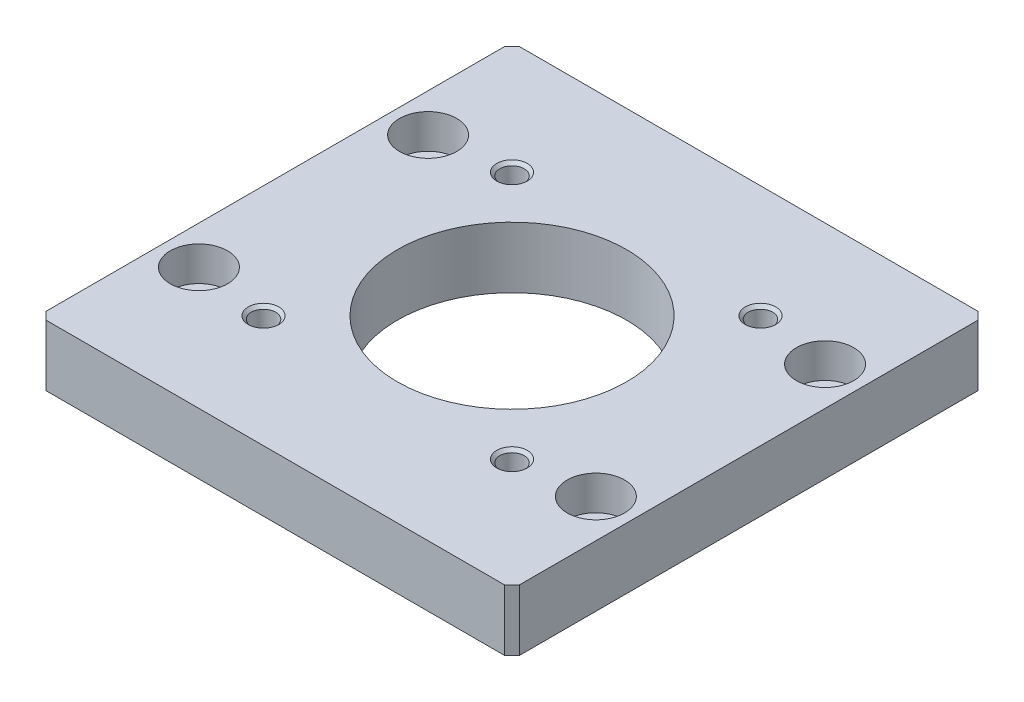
ISO-10303-21;
HEADER;
FILE_DESCRIPTION(('STEP AP214'),'2;1');
FILE_NAME('part.step','',(''),(''),'','','');
FILE_SCHEMA(('AUTOMOTIVE_DESIGN { 1 0 10303 214 1 1 1 1 }'));
ENDSEC;
DATA;
#1=APPLICATION_CONTEXT('core data for automotive mechanical design processes');
#2=APPLICATION_PROTOCOL_DEFINITION('international standard','automotive_design',2000,#1);
#3=PRODUCT_CONTEXT('',#1,'mechanical');
#4=PRODUCT('Part','Part','',(#3));
#5=PRODUCT_RELATED_PRODUCT_CATEGORY('part','',(#4));
#6=PRODUCT_DEFINITION_FORMATION('','',#4);
#7=PRODUCT_DEFINITION_CONTEXT('part definition',#1,'design');
#8=PRODUCT_DEFINITION('design','',#6,#7);
#9=PRODUCT_DEFINITION_SHAPE('','',#8);
#10=(LENGTH_UNIT() NAMED_UNIT(*) SI_UNIT(.MILLI.,.METRE.));
#11=(NAMED_UNIT(*) PLANE_ANGLE_UNIT() SI_UNIT($,.RADIAN.));
#12=(NAMED_UNIT(*) SI_UNIT($,.STERADIAN.) SOLID_ANGLE_UNIT());
#13=UNCERTAINTY_MEASURE_WITH_UNIT(LENGTH_MEASURE(1.E-05),#10,'distance_accuracy_value','');
#14=(GEOMETRIC_REPRESENTATION_CONTEXT(3) GLOBAL_UNCERTAINTY_ASSIGNED_CONTEXT((#13)) GLOBAL_UNIT_ASSIGNED_CONTEXT((#10,
#11,#12)) REPRESENTATION_CONTEXT('',''));
#15=CARTESIAN_POINT('',(0.,0.,0.));
#16=DIRECTION('',(0.,0.,1.));
#17=DIRECTION('',(1.,0.,0.));
#18=AXIS2_PLACEMENT_3D('',#15,#16,#17);
#19=CARTESIAN_POINT('',(-16.26345596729,7.59999999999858,-16.26345596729));
#20=DIRECTION('',(0.,1.,0.));
#21=DIRECTION('',(0.,0.,1.));
#22=AXIS2_PLACEMENT_3D('',#19,#20,#21);
#23=CONICAL_SURFACE('',#22,1.60000000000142,0.785398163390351);
#24=CARTESIAN_POINT('',(-16.26345596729,7.6,-16.26345596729));
#25=DIRECTION('',(0.,1.,0.));
#26=DIRECTION('',(1.,0.,0.));
#27=AXIS2_PLACEMENT_3D('',#24,#25,#26);
#28=CIRCLE('',#27,1.6);
#29=CARTESIAN_POINT('',(-14.66345596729,7.6,-16.26345596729));
#30=VERTEX_POINT('',#29);
#31=EDGE_CURVE('E191',#30,#30,#28,.F.);
#32=ORIENTED_EDGE('',*,*,#31,.T.);
#33=EDGE_LOOP('',(#32));
#34=FACE_BOUND('',#33,.T.);
#35=CARTESIAN_POINT('',(-16.26345596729,8.00000000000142,-16.26345596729));
#36=DIRECTION('',(0.,1.,0.));
#37=DIRECTION('',(0.,0.,1.));
#38=AXIS2_PLACEMENT_3D('',#35,#36,#37);
#39=CIRCLE('',#38,1.99999999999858);
#40=CARTESIAN_POINT('',(-16.26345596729,8.00000000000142,-14.2634559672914));
#41=VERTEX_POINT('',#40);
#42=EDGE_CURVE('E174',#41,#41,#39,.T.);
#43=ORIENTED_EDGE('',*,*,#42,.T.);
#44=EDGE_LOOP('',(#43));
#45=FACE_BOUND('',#44,.T.);
#46=ADVANCED_FACE('F16',(#34,#45),#23,.F.);
#47=CARTESIAN_POINT('',(16.26345596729,7.59999999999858,-16.26345596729));
#48=DIRECTION('',(0.,1.,0.));
#49=DIRECTION('',(0.,0.,1.));
#50=AXIS2_PLACEMENT_3D('',#47,#48,#49);
#51=CONICAL_SURFACE('',#50,1.60000000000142,0.785398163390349);
#52=CARTESIAN_POINT('',(16.26345596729,7.6,-16.26345596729));
#53=DIRECTION('',(0.,1.,0.));
#54=DIRECTION('',(1.,0.,0.));
#55=AXIS2_PLACEMENT_3D('',#52,#53,#54);
#56=CIRCLE('',#55,1.6);
#57=CARTESIAN_POINT('',(17.86345596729,7.6,-16.26345596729));
#58=VERTEX_POINT('',#57);
#59=EDGE_CURVE('E195',#58,#58,#56,.F.);
#60=ORIENTED_EDGE('',*,*,#59,.T.);
#61=EDGE_LOOP('',(#60));
#62=FACE_BOUND('',#61,.T.);
#63=CARTESIAN_POINT('',(16.26345596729,8.00000000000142,-16.26345596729));
#64=DIRECTION('',(0.,1.,0.));
#65=DIRECTION('',(0.,0.,1.));
#66=AXIS2_PLACEMENT_3D('',#63,#64,#65);
#67=CIRCLE('',#66,1.99999999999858);
#68=CARTESIAN_POINT('',(16.26345596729,8.00000000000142,-14.2634559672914));
#69=VERTEX_POINT('',#68);
#70=EDGE_CURVE('E171',#69,#69,#67,.T.);
#71=ORIENTED_EDGE('',*,*,#70,.T.);
#72=EDGE_LOOP('',(#71));
#73=FACE_BOUND('',#72,.T.);
#74=ADVANCED_FACE('F359',(#62,#73),#51,.F.);
#75=CARTESIAN_POINT('',(-16.26345596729,7.59999999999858,16.26345596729));
#76=DIRECTION('',(0.,1.,0.));
#77=DIRECTION('',(0.,0.,1.));
#78=AXIS2_PLACEMENT_3D('',#75,#76,#77);
#79=CONICAL_SURFACE('',#78,1.60000000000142,0.785398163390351);
#80=CARTESIAN_POINT('',(-16.26345596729,7.6,16.26345596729));
#81=DIRECTION('',(0.,1.,0.));
#82=DIRECTION('',(1.,0.,0.));
#83=AXIS2_PLACEMENT_3D('',#80,#81,#82);
#84=CIRCLE('',#83,1.6);
#85=CARTESIAN_POINT('',(-14.66345596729,7.6,16.26345596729));
#86=VERTEX_POINT('',#85);
#87=EDGE_CURVE('E208',#86,#86,#84,.F.);
#88=ORIENTED_EDGE('',*,*,#87,.T.);
#89=EDGE_LOOP('',(#88));
#90=FACE_BOUND('',#89,.T.);
#91=CARTESIAN_POINT('',(-16.26345596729,8.00000000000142,16.26345596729));
#92=DIRECTION('',(0.,1.,0.));
#93=DIRECTION('',(0.,0.,1.));
#94=AXIS2_PLACEMENT_3D('',#91,#92,#93);
#95=CIRCLE('',#94,1.99999999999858);
#96=CARTESIAN_POINT('',(-16.26345596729,8.00000000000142,18.2634559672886));
#97=VERTEX_POINT('',#96);
#98=EDGE_CURVE('E168',#97,#97,#95,.T.);
#99=ORIENTED_EDGE('',*,*,#98,.T.);
#100=EDGE_LOOP('',(#99));
#101=FACE_BOUND('',#100,.T.);
#102=ADVANCED_FACE('F355',(#90,#101),#79,.F.);
#103=CARTESIAN_POINT('',(16.26345596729,7.59999999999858,16.26345596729));
#104=DIRECTION('',(0.,1.,0.));
#105=DIRECTION('',(0.,0.,1.));
#106=AXIS2_PLACEMENT_3D('',#103,#104,#105);
#107=CONICAL_SURFACE('',#106,1.60000000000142,0.785398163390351);
#108=CARTESIAN_POINT('',(16.26345596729,7.6,16.26345596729));
#109=DIRECTION('',(0.,1.,0.));
#110=DIRECTION('',(1.,0.,0.));
#111=AXIS2_PLACEMENT_3D('',#108,#109,#110);
#112=CIRCLE('',#111,1.6);
#113=CARTESIAN_POINT('',(17.86345596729,7.6,16.26345596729));
#114=VERTEX_POINT('',#113);
#115=EDGE_CURVE('E200',#114,#114,#112,.F.);
#116=ORIENTED_EDGE('',*,*,#115,.T.);
#117=EDGE_LOOP('',(#116));
#118=FACE_BOUND('',#117,.T.);
#119=CARTESIAN_POINT('',(16.26345596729,8.00000000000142,16.26345596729));
#120=DIRECTION('',(0.,1.,0.));
#121=DIRECTION('',(0.,0.,1.));
#122=AXIS2_PLACEMENT_3D('',#119,#120,#121);
#123=CIRCLE('',#122,1.99999999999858);
#124=CARTESIAN_POINT('',(16.26345596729,8.00000000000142,18.2634559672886));
#125=VERTEX_POINT('',#124);
#126=EDGE_CURVE('E165',#125,#125,#123,.T.);
#127=ORIENTED_EDGE('',*,*,#126,.T.);
#128=EDGE_LOOP('',(#127));
#129=FACE_BOUND('',#128,.T.);
#130=ADVANCED_FACE('F352',(#118,#129),#107,.F.);
#131=CARTESIAN_POINT('',(25.98076211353,3.5,-15.));
#132=DIRECTION('',(0.,1.,0.));
#133=DIRECTION('',(0.,0.,1.));
#134=AXIS2_PLACEMENT_3D('',#131,#132,#133);
#135=CYLINDRICAL_SURFACE('',#134,3.75);
#136=CARTESIAN_POINT('',(25.98076211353,3.5,-15.));
#137=DIRECTION('',(0.,1.,0.));
#138=DIRECTION('',(0.,0.,1.));
#139=AXIS2_PLACEMENT_3D('',#136,#137,#138);
#140=CIRCLE('',#139,3.75);
#141=CARTESIAN_POINT('',(25.98076211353,3.5,-11.25));
#142=VERTEX_POINT('',#141);
#143=EDGE_CURVE('E20',#142,#142,#140,.F.);
#144=ORIENTED_EDGE('',*,*,#143,.T.);
#145=EDGE_LOOP('',(#144));
#146=FACE_BOUND('',#145,.T.);
#147=CARTESIAN_POINT('',(25.98076211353,8.,-15.));
#148=DIRECTION('',(0.,1.,0.));
#149=DIRECTION('',(0.,0.,1.));
#150=AXIS2_PLACEMENT_3D('',#147,#148,#149);
#151=CIRCLE('',#150,3.75);
#152=CARTESIAN_POINT('',(25.98076211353,8.,-11.25));
#153=VERTEX_POINT('',#152);
#154=EDGE_CURVE('E162',#153,#153,#151,.T.);
#155=ORIENTED_EDGE('',*,*,#154,.T.);
#156=EDGE_LOOP('',(#155));
#157=FACE_BOUND('',#156,.T.);
#158=ADVANCED_FACE('F348',(#146,#157),#135,.F.);
#159=CARTESIAN_POINT('',(-25.98076211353,3.5,-15.));
#160=DIRECTION('',(0.,1.,0.));
#161=DIRECTION('',(0.,0.,1.));
#162=AXIS2_PLACEMENT_3D('',#159,#160,#161);
#163=CYLINDRICAL_SURFACE('',#162,3.75);
#164=CARTESIAN_POINT('',(-25.98076211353,3.5,-15.));
#165=DIRECTION('',(0.,1.,0.));
#166=DIRECTION('',(0.,0.,1.));
#167=AXIS2_PLACEMENT_3D('',#164,#165,#166);
#168=CIRCLE('',#167,3.75);
#169=CARTESIAN_POINT('',(-25.98076211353,3.5,-11.25));
#170=VERTEX_POINT('',#169);
#171=EDGE_CURVE('E184',#170,#170,#168,.F.);
#172=ORIENTED_EDGE('',*,*,#171,.T.);
#173=EDGE_LOOP('',(#172));
#174=FACE_BOUND('',#173,.T.);
#175=CARTESIAN_POINT('',(-25.98076211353,8.,-15.));
#176=DIRECTION('',(0.,1.,0.));
#177=DIRECTION('',(0.,0.,1.));
#178=AXIS2_PLACEMENT_3D('',#175,#176,#177);
#179=CIRCLE('',#178,3.75);
#180=CARTESIAN_POINT('',(-25.98076211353,8.,-11.25));
#181=VERTEX_POINT('',#180);
#182=EDGE_CURVE('E159',#181,#181,#179,.T.);
#183=ORIENTED_EDGE('',*,*,#182,.T.);
#184=EDGE_LOOP('',(#183));
#185=FACE_BOUND('',#184,.T.);
#186=ADVANCED_FACE('F344',(#174,#185),#163,.F.);
#187=CARTESIAN_POINT('',(-25.98076211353,3.5,15.));
#188=DIRECTION('',(0.,1.,0.));
#189=DIRECTION('',(0.,0.,1.));
#190=AXIS2_PLACEMENT_3D('',#187,#188,#189);
#191=CYLINDRICAL_SURFACE('',#190,3.75);
#192=CARTESIAN_POINT('',(-25.98076211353,3.5,15.));
#193=DIRECTION('',(0.,1.,0.));
#194=DIRECTION('',(0.,0.,1.));
#195=AXIS2_PLACEMENT_3D('',#192,#193,#194);
#196=CIRCLE('',#195,3.75);
#197=CARTESIAN_POINT('',(-25.98076211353,3.5,18.75));
#198=VERTEX_POINT('',#197);
#199=EDGE_CURVE('E90',#198,#198,#196,.F.);
#200=ORIENTED_EDGE('',*,*,#199,.T.);
#201=EDGE_LOOP('',(#200));
#202=FACE_BOUND('',#201,.T.);
#203=CARTESIAN_POINT('',(-25.98076211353,8.,15.));
#204=DIRECTION('',(0.,1.,0.));
#205=DIRECTION('',(0.,0.,1.));
#206=AXIS2_PLACEMENT_3D('',#203,#204,#205);
#207=CIRCLE('',#206,3.75);
#208=CARTESIAN_POINT('',(-25.98076211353,8.,18.75));
#209=VERTEX_POINT('',#208);
#210=EDGE_CURVE('E107',#209,#209,#207,.T.);
#211=ORIENTED_EDGE('',*,*,#210,.T.);
#212=EDGE_LOOP('',(#211));
#213=FACE_BOUND('',#212,.T.);
#214=ADVANCED_FACE('F341',(#202,#213),#191,.F.);
#215=CARTESIAN_POINT('',(25.98076211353,3.5,15.));
#216=DIRECTION('',(0.,1.,0.));
#217=DIRECTION('',(0.,0.,1.));
#218=AXIS2_PLACEMENT_3D('',#215,#216,#217);
#219=CYLINDRICAL_SURFACE('',#218,3.75);
#220=CARTESIAN_POINT('',(25.98076211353,3.5,15.));
#221=DIRECTION('',(0.,1.,0.));
#222=DIRECTION('',(0.,0.,1.));
#223=AXIS2_PLACEMENT_3D('',#220,#221,#222);
#224=CIRCLE('',#223,3.75);
#225=CARTESIAN_POINT('',(25.98076211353,3.5,18.75));
#226=VERTEX_POINT('',#225);
#227=EDGE_CURVE('E186',#226,#226,#224,.F.);
#228=ORIENTED_EDGE('',*,*,#227,.T.);
#229=EDGE_LOOP('',(#228));
#230=FACE_BOUND('',#229,.T.);
#231=CARTESIAN_POINT('',(25.98076211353,8.,15.));
#232=DIRECTION('',(0.,1.,0.));
#233=DIRECTION('',(0.,0.,1.));
#234=AXIS2_PLACEMENT_3D('',#231,#232,#233);
#235=CIRCLE('',#234,3.75);
#236=CARTESIAN_POINT('',(25.98076211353,8.,18.75));
#237=VERTEX_POINT('',#236);
#238=EDGE_CURVE('E104',#237,#237,#235,.T.);
#239=ORIENTED_EDGE('',*,*,#238,.T.);
#240=EDGE_LOOP('',(#239));
#241=FACE_BOUND('',#240,.T.);
#242=ADVANCED_FACE('F338',(#230,#241),#219,.F.);
#243=CARTESIAN_POINT('',(-31.08184,8.16,-29.91816));
#244=DIRECTION('',(-0.707106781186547,0.,-0.707106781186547));
#245=DIRECTION('',(0.707106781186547,0.,-0.707106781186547));
#246=AXIS2_PLACEMENT_3D('',#243,#244,#245);
#247=PLANE('',#246);
#248=DIRECTION('',(0.707106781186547,0.,-0.707106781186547));
#249=VECTOR('',#248,1.);
#250=CARTESIAN_POINT('',(-31.08184,8.,-29.91816));
#251=LINE('',#250,#249);
#252=CARTESIAN_POINT('',(-31.,8.,-30.));
#253=VERTEX_POINT('',#252);
#254=CARTESIAN_POINT('',(-30.,8.,-31.));
#255=VERTEX_POINT('',#254);
#256=EDGE_CURVE('E177',#253,#255,#251,.T.);
#257=ORIENTED_EDGE('',*,*,#256,.T.);
#258=DIRECTION('',(0.,1.,0.));
#259=VECTOR('',#258,1.);
#260=CARTESIAN_POINT('',(-30.,4.,-31.));
#261=LINE('',#260,#259);
#262=CARTESIAN_POINT('',(-30.,0.,-31.));
#263=VERTEX_POINT('',#262);
#264=EDGE_CURVE('E100',#255,#263,#261,.F.);
#265=ORIENTED_EDGE('',*,*,#264,.T.);
#266=DIRECTION('',(-0.707106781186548,0.,0.707106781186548));
#267=VECTOR('',#266,1.);
#268=CARTESIAN_POINT('',(-30.5,0.,-30.5));
#269=LINE('',#268,#267);
#270=CARTESIAN_POINT('',(-31.,0.,-30.));
#271=VERTEX_POINT('',#270);
#272=EDGE_CURVE('E203',#271,#263,#269,.F.);
#273=ORIENTED_EDGE('',*,*,#272,.F.);
#274=DIRECTION('',(0.,-1.,0.));
#275=VECTOR('',#274,1.);
#276=CARTESIAN_POINT('',(-31.,4.,-30.));
#277=LINE('',#276,#275);
#278=EDGE_CURVE('E215',#271,#253,#277,.F.);
#279=ORIENTED_EDGE('',*,*,#278,.T.);
#280=EDGE_LOOP('',(#257,#265,#273,#279));
#281=FACE_BOUND('',#280,.T.);
#282=ADVANCED_FACE('F261',(#281),#247,.T.);
#283=CARTESIAN_POINT('',(-29.91816,8.16,31.08184));
#284=DIRECTION('',(-0.707106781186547,0.,0.707106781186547));
#285=DIRECTION('',(-0.707106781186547,0.,-0.707106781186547));
#286=AXIS2_PLACEMENT_3D('',#283,#284,#285);
#287=PLANE('',#286);
#288=DIRECTION('',(-0.707106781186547,0.,-0.707106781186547));
#289=VECTOR('',#288,1.);
#290=CARTESIAN_POINT('',(-29.91816,8.,31.08184));
#291=LINE('',#290,#289);
#292=CARTESIAN_POINT('',(-30.,8.,31.));
#293=VERTEX_POINT('',#292);
#294=CARTESIAN_POINT('',(-31.,8.,30.));
#295=VERTEX_POINT('',#294);
#296=EDGE_CURVE('E179',#293,#295,#291,.T.);
#297=ORIENTED_EDGE('',*,*,#296,.T.);
#298=DIRECTION('',(0.,1.,0.));
#299=VECTOR('',#298,1.);
#300=CARTESIAN_POINT('',(-31.,4.,30.));
#301=LINE('',#300,#299);
#302=CARTESIAN_POINT('',(-31.,0.,30.));
#303=VERTEX_POINT('',#302);
#304=EDGE_CURVE('E214',#295,#303,#301,.F.);
#305=ORIENTED_EDGE('',*,*,#304,.T.);
#306=DIRECTION('',(0.707106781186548,0.,0.707106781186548));
#307=VECTOR('',#306,1.);
#308=CARTESIAN_POINT('',(-30.5,0.,30.5));
#309=LINE('',#308,#307);
#310=CARTESIAN_POINT('',(-30.,0.,31.));
#311=VERTEX_POINT('',#310);
#312=EDGE_CURVE('E257',#311,#303,#309,.F.);
#313=ORIENTED_EDGE('',*,*,#312,.F.);
#314=DIRECTION('',(0.,-1.,0.));
#315=VECTOR('',#314,1.);
#316=CARTESIAN_POINT('',(-30.,4.,31.));
#317=LINE('',#316,#315);
#318=EDGE_CURVE('E222',#311,#293,#317,.F.);
#319=ORIENTED_EDGE('',*,*,#318,.T.);
#320=EDGE_LOOP('',(#297,#305,#313,#319));
#321=FACE_BOUND('',#320,.T.);
#322=ADVANCED_FACE('F267',(#321),#287,.T.);
#323=CARTESIAN_POINT('',(29.91816,8.16,-31.08184));
#324=DIRECTION('',(0.707106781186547,0.,-0.707106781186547));
#325=DIRECTION('',(0.707106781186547,0.,0.707106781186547));
#326=AXIS2_PLACEMENT_3D('',#323,#324,#325);
#327=PLANE('',#326);
#328=DIRECTION('',(0.707106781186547,0.,0.707106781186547));
#329=VECTOR('',#328,1.);
#330=CARTESIAN_POINT('',(29.91816,8.,-31.08184));
#331=LINE('',#330,#329);
#332=CARTESIAN_POINT('',(30.,8.,-31.));
#333=VERTEX_POINT('',#332);
#334=CARTESIAN_POINT('',(31.,8.,-30.));
#335=VERTEX_POINT('',#334);
#336=EDGE_CURVE('E80',#333,#335,#331,.T.);
#337=ORIENTED_EDGE('',*,*,#336,.T.);
#338=DIRECTION('',(0.,1.,0.));
#339=VECTOR('',#338,1.);
#340=CARTESIAN_POINT('',(31.,4.,-30.));
#341=LINE('',#340,#339);
#342=CARTESIAN_POINT('',(31.,0.,-30.));
#343=VERTEX_POINT('',#342);
#344=EDGE_CURVE('E113',#335,#343,#341,.F.);
#345=ORIENTED_EDGE('',*,*,#344,.T.);
#346=DIRECTION('',(-0.707106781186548,0.,-0.707106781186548));
#347=VECTOR('',#346,1.);
#348=CARTESIAN_POINT('',(30.5,0.,-30.5));
#349=LINE('',#348,#347);
#350=CARTESIAN_POINT('',(30.,0.,-31.));
#351=VERTEX_POINT('',#350);
#352=EDGE_CURVE('E103',#351,#343,#349,.F.);
#353=ORIENTED_EDGE('',*,*,#352,.F.);
#354=DIRECTION('',(0.,-1.,0.));
#355=VECTOR('',#354,1.);
#356=CARTESIAN_POINT('',(30.,4.,-31.));
#357=LINE('',#356,#355);
#358=EDGE_CURVE('E97',#351,#333,#357,.F.);
#359=ORIENTED_EDGE('',*,*,#358,.T.);
#360=EDGE_LOOP('',(#337,#345,#353,#359));
#361=FACE_BOUND('',#360,.T.);
#362=ADVANCED_FACE('F102',(#361),#327,.T.);
#363=CARTESIAN_POINT('',(31.08184,8.16,29.91816));
#364=DIRECTION('',(0.707106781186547,0.,0.707106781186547));
#365=DIRECTION('',(-0.707106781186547,0.,0.707106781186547));
#366=AXIS2_PLACEMENT_3D('',#363,#364,#365);
#367=PLANE('',#366);
#368=DIRECTION('',(-0.707106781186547,0.,0.707106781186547));
#369=VECTOR('',#368,1.);
#370=CARTESIAN_POINT('',(31.08184,8.,29.91816));
#371=LINE('',#370,#369);
#372=CARTESIAN_POINT('',(31.,8.,30.));
#373=VERTEX_POINT('',#372);
#374=CARTESIAN_POINT('',(30.,8.,31.));
#375=VERTEX_POINT('',#374);
#376=EDGE_CURVE('E89',#373,#375,#371,.T.);
#377=ORIENTED_EDGE('',*,*,#376,.T.);
#378=DIRECTION('',(0.,1.,0.));
#379=VECTOR('',#378,1.);
#380=CARTESIAN_POINT('',(30.,4.,31.));
#381=LINE('',#380,#379);
#382=CARTESIAN_POINT('',(30.,0.,31.));
#383=VERTEX_POINT('',#382);
#384=EDGE_CURVE('E111',#375,#383,#381,.F.);
#385=ORIENTED_EDGE('',*,*,#384,.T.);
#386=DIRECTION('',(0.707106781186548,0.,-0.707106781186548));
#387=VECTOR('',#386,1.);
#388=CARTESIAN_POINT('',(30.5,0.,30.5));
#389=LINE('',#388,#387);
#390=CARTESIAN_POINT('',(31.,0.,30.));
#391=VERTEX_POINT('',#390);
#392=EDGE_CURVE('E35',#391,#383,#389,.F.);
#393=ORIENTED_EDGE('',*,*,#392,.F.);
#394=DIRECTION('',(0.,-1.,0.));
#395=VECTOR('',#394,1.);
#396=CARTESIAN_POINT('',(31.,4.,30.));
#397=LINE('',#396,#395);
#398=EDGE_CURVE('E114',#391,#373,#397,.F.);
#399=ORIENTED_EDGE('',*,*,#398,.T.);
#400=EDGE_LOOP('',(#377,#385,#393,#399));
#401=FACE_BOUND('',#400,.T.);
#402=ADVANCED_FACE('F228',(#401),#367,.T.);
#403=CARTESIAN_POINT('',(-16.26345596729,0.4,16.26345596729));
#404=DIRECTION('',(0.,1.,0.));
#405=DIRECTION('',(0.,0.,1.));
#406=AXIS2_PLACEMENT_3D('',#403,#404,#405);
#407=CYLINDRICAL_SURFACE('',#406,1.6);
#408=CARTESIAN_POINT('',(-16.26345596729,0.40000000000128,16.26345596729));
#409=DIRECTION('',(0.,-1.,0.));
#410=DIRECTION('',(0.,0.,-1.));
#411=AXIS2_PLACEMENT_3D('',#408,#409,#410);
#412=CIRCLE('',#411,1.60000000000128);
#413=CARTESIAN_POINT('',(-16.26345596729,0.40000000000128,14.6634559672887));
#414=VERTEX_POINT('',#413);
#415=EDGE_CURVE('E227',#414,#414,#412,.T.);
#416=ORIENTED_EDGE('',*,*,#415,.T.);
#417=EDGE_LOOP('',(#416));
#418=FACE_BOUND('',#417,.T.);
#419=ORIENTED_EDGE('',*,*,#87,.F.);
#420=EDGE_LOOP('',(#419));
#421=FACE_BOUND('',#420,.T.);
#422=ADVANCED_FACE('F333',(#418,#421),#407,.F.);
#423=CARTESIAN_POINT('',(16.26345596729,0.4,16.26345596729));
#424=DIRECTION('',(0.,1.,0.));
#425=DIRECTION('',(0.,0.,1.));
#426=AXIS2_PLACEMENT_3D('',#423,#424,#425);
#427=CYLINDRICAL_SURFACE('',#426,1.6);
#428=CARTESIAN_POINT('',(16.26345596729,0.40000000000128,16.26345596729));
#429=DIRECTION('',(0.,-1.,0.));
#430=DIRECTION('',(0.,0.,-1.));
#431=AXIS2_PLACEMENT_3D('',#428,#429,#430);
#432=CIRCLE('',#431,1.60000000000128);
#433=CARTESIAN_POINT('',(16.26345596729,0.40000000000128,14.6634559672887));
#434=VERTEX_POINT('',#433);
#435=EDGE_CURVE('E251',#434,#434,#432,.T.);
#436=ORIENTED_EDGE('',*,*,#435,.T.);
#437=EDGE_LOOP('',(#436));
#438=FACE_BOUND('',#437,.T.);
#439=ORIENTED_EDGE('',*,*,#115,.F.);
#440=EDGE_LOOP('',(#439));
#441=FACE_BOUND('',#440,.T.);
#442=ADVANCED_FACE('F329',(#438,#441),#427,.F.);
#443=CARTESIAN_POINT('',(16.26345596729,0.4,-16.26345596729));
#444=DIRECTION('',(0.,1.,0.));
#445=DIRECTION('',(0.,0.,1.));
#446=AXIS2_PLACEMENT_3D('',#443,#444,#445);
#447=CYLINDRICAL_SURFACE('',#446,1.6);
#448=CARTESIAN_POINT('',(16.26345596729,0.40000000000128,-16.26345596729));
#449=DIRECTION('',(0.,-1.,0.));
#450=DIRECTION('',(0.,0.,-1.));
#451=AXIS2_PLACEMENT_3D('',#448,#449,#450);
#452=CIRCLE('',#451,1.60000000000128);
#453=CARTESIAN_POINT('',(16.26345596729,0.40000000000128,-17.8634559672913));
#454=VERTEX_POINT('',#453);
#455=EDGE_CURVE('E248',#454,#454,#452,.T.);
#456=ORIENTED_EDGE('',*,*,#455,.T.);
#457=EDGE_LOOP('',(#456));
#458=FACE_BOUND('',#457,.T.);
#459=ORIENTED_EDGE('',*,*,#59,.F.);
#460=EDGE_LOOP('',(#459));
#461=FACE_BOUND('',#460,.T.);
#462=ADVANCED_FACE('F325',(#458,#461),#447,.F.);
#463=CARTESIAN_POINT('',(-16.26345596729,0.4,-16.26345596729));
#464=DIRECTION('',(0.,1.,0.));
#465=DIRECTION('',(0.,0.,1.));
#466=AXIS2_PLACEMENT_3D('',#463,#464,#465);
#467=CYLINDRICAL_SURFACE('',#466,1.6);
#468=CARTESIAN_POINT('',(-16.26345596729,0.40000000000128,-16.26345596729));
#469=DIRECTION('',(0.,-1.,0.));
#470=DIRECTION('',(0.,0.,-1.));
#471=AXIS2_PLACEMENT_3D('',#468,#469,#470);
#472=CIRCLE('',#471,1.60000000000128);
#473=CARTESIAN_POINT('',(-16.26345596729,0.40000000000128,-17.8634559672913));
#474=VERTEX_POINT('',#473);
#475=EDGE_CURVE('E155',#474,#474,#472,.T.);
#476=ORIENTED_EDGE('',*,*,#475,.T.);
#477=EDGE_LOOP('',(#476));
#478=FACE_BOUND('',#477,.T.);
#479=ORIENTED_EDGE('',*,*,#31,.F.);
#480=EDGE_LOOP('',(#479));
#481=FACE_BOUND('',#480,.T.);
#482=ADVANCED_FACE('F321',(#478,#481),#467,.F.);
#483=CARTESIAN_POINT('',(-30.91999259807,3.5,19.50812731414));
#484=DIRECTION('',(0.,1.,0.));
#485=DIRECTION('',(1.,0.,0.));
#486=AXIS2_PLACEMENT_3D('',#483,#484,#485);
#487=PLANE('',#486);
#488=CARTESIAN_POINT('',(25.98076211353,3.5,-15.));
#489=DIRECTION('',(0.,1.,0.));
#490=DIRECTION('',(0.,0.,1.));
#491=AXIS2_PLACEMENT_3D('',#488,#489,#490);
#492=CIRCLE('',#491,2.25);
#493=CARTESIAN_POINT('',(25.98076211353,3.5,-12.75));
#494=VERTEX_POINT('',#493);
#495=EDGE_CURVE('E153',#494,#494,#492,.F.);
#496=ORIENTED_EDGE('',*,*,#495,.T.);
#497=EDGE_LOOP('',(#496));
#498=FACE_BOUND('',#497,.T.);
#499=ORIENTED_EDGE('',*,*,#143,.F.);
#500=EDGE_LOOP('',(#499));
#501=FACE_BOUND('',#500,.T.);
#502=ADVANCED_FACE('F324',(#498,#501),#487,.T.);
#503=CARTESIAN_POINT('',(-30.91999259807,3.5,19.50812731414));
#504=DIRECTION('',(0.,1.,0.));
#505=DIRECTION('',(1.,0.,0.));
#506=AXIS2_PLACEMENT_3D('',#503,#504,#505);
#507=PLANE('',#506);
#508=CARTESIAN_POINT('',(25.98076211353,3.5,15.));
#509=DIRECTION('',(0.,1.,0.));
#510=DIRECTION('',(0.,0.,1.));
#511=AXIS2_PLACEMENT_3D('',#508,#509,#510);
#512=CIRCLE('',#511,2.25);
#513=CARTESIAN_POINT('',(25.98076211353,3.5,17.25));
#514=VERTEX_POINT('',#513);
#515=EDGE_CURVE('E150',#514,#514,#512,.F.);
#516=ORIENTED_EDGE('',*,*,#515,.T.);
#517=EDGE_LOOP('',(#516));
#518=FACE_BOUND('',#517,.T.);
#519=ORIENTED_EDGE('',*,*,#227,.F.);
#520=EDGE_LOOP('',(#519));
#521=FACE_BOUND('',#520,.T.);
#522=ADVANCED_FACE('F376',(#518,#521),#507,.T.);
#523=CARTESIAN_POINT('',(-30.91999259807,3.5,19.50812731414));
#524=DIRECTION('',(0.,1.,0.));
#525=DIRECTION('',(1.,0.,0.));
#526=AXIS2_PLACEMENT_3D('',#523,#524,#525);
#527=PLANE('',#526);
#528=CARTESIAN_POINT('',(-25.98076211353,3.5,-15.));
#529=DIRECTION('',(0.,1.,0.));
#530=DIRECTION('',(0.,0.,1.));
#531=AXIS2_PLACEMENT_3D('',#528,#529,#530);
#532=CIRCLE('',#531,2.25);
#533=CARTESIAN_POINT('',(-25.98076211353,3.5,-12.75));
#534=VERTEX_POINT('',#533);
#535=EDGE_CURVE('E147',#534,#534,#532,.F.);
#536=ORIENTED_EDGE('',*,*,#535,.T.);
#537=EDGE_LOOP('',(#536));
#538=FACE_BOUND('',#537,.T.);
#539=ORIENTED_EDGE('',*,*,#171,.F.);
#540=EDGE_LOOP('',(#539));
#541=FACE_BOUND('',#540,.T.);
#542=ADVANCED_FACE('F380',(#538,#541),#527,.T.);
#543=CARTESIAN_POINT('',(-30.91999259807,3.5,19.50812731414));
#544=DIRECTION('',(0.,1.,0.));
#545=DIRECTION('',(1.,0.,0.));
#546=AXIS2_PLACEMENT_3D('',#543,#544,#545);
#547=PLANE('',#546);
#548=CARTESIAN_POINT('',(-25.98076211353,3.5,15.));
#549=DIRECTION('',(0.,1.,0.));
#550=DIRECTION('',(0.,0.,1.));
#551=AXIS2_PLACEMENT_3D('',#548,#549,#550);
#552=CIRCLE('',#551,2.25);
#553=CARTESIAN_POINT('',(-25.98076211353,3.5,17.25));
#554=VERTEX_POINT('',#553);
#555=EDGE_CURVE('E144',#554,#554,#552,.F.);
#556=ORIENTED_EDGE('',*,*,#555,.T.);
#557=EDGE_LOOP('',(#556));
#558=FACE_BOUND('',#557,.T.);
#559=ORIENTED_EDGE('',*,*,#199,.F.);
#560=EDGE_LOOP('',(#559));
#561=FACE_BOUND('',#560,.T.);
#562=ADVANCED_FACE('F384',(#558,#561),#547,.T.);
#563=CARTESIAN_POINT('',(-32.24,8.,32.24));
#564=DIRECTION('',(0.,1.,0.));
#565=DIRECTION('',(1.,0.,0.));
#566=AXIS2_PLACEMENT_3D('',#563,#564,#565);
#567=PLANE('',#566);
#568=CARTESIAN_POINT('',(0.,8.,0.));
#569=DIRECTION('',(0.,1.,0.));
#570=DIRECTION('',(0.,0.,1.));
#571=AXIS2_PLACEMENT_3D('',#568,#569,#570);
#572=CIRCLE('',#571,15.);
#573=CARTESIAN_POINT('',(0.,8.,15.));
#574=VERTEX_POINT('',#573);
#575=EDGE_CURVE('E140',#574,#574,#572,.F.);
#576=ORIENTED_EDGE('',*,*,#575,.T.);
#577=EDGE_LOOP('',(#576));
#578=FACE_BOUND('',#577,.T.);
#579=ORIENTED_EDGE('',*,*,#238,.F.);
#580=EDGE_LOOP('',(#579));
#581=FACE_BOUND('',#580,.T.);
#582=ORIENTED_EDGE('',*,*,#210,.F.);
#583=EDGE_LOOP('',(#582));
#584=FACE_BOUND('',#583,.T.);
#585=ORIENTED_EDGE('',*,*,#182,.F.);
#586=EDGE_LOOP('',(#585));
#587=FACE_BOUND('',#586,.T.);
#588=ORIENTED_EDGE('',*,*,#154,.F.);
#589=EDGE_LOOP('',(#588));
#590=FACE_BOUND('',#589,.T.);
#591=ORIENTED_EDGE('',*,*,#126,.F.);
#592=EDGE_LOOP('',(#591));
#593=FACE_BOUND('',#592,.T.);
#594=ORIENTED_EDGE('',*,*,#98,.F.);
#595=EDGE_LOOP('',(#594));
#596=FACE_BOUND('',#595,.T.);
#597=ORIENTED_EDGE('',*,*,#70,.F.);
#598=EDGE_LOOP('',(#597));
#599=FACE_BOUND('',#598,.T.);
#600=ORIENTED_EDGE('',*,*,#42,.F.);
#601=EDGE_LOOP('',(#600));
#602=FACE_BOUND('',#601,.T.);
#603=ORIENTED_EDGE('',*,*,#256,.F.);
#604=DIRECTION('',(0.,0.,-1.));
#605=VECTOR('',#604,1.);
#606=CARTESIAN_POINT('',(-31.,8.,0.));
#607=LINE('',#606,#605);
#608=EDGE_CURVE('E211',#253,#295,#607,.F.);
#609=ORIENTED_EDGE('',*,*,#608,.T.);
#610=ORIENTED_EDGE('',*,*,#296,.F.);
#611=DIRECTION('',(-1.,0.,0.));
#612=VECTOR('',#611,1.);
#613=CARTESIAN_POINT('',(0.,8.,31.));
#614=LINE('',#613,#612);
#615=EDGE_CURVE('E219',#293,#375,#614,.F.);
#616=ORIENTED_EDGE('',*,*,#615,.T.);
#617=ORIENTED_EDGE('',*,*,#376,.F.);
#618=DIRECTION('',(0.,0.,1.));
#619=VECTOR('',#618,1.);
#620=CARTESIAN_POINT('',(31.,8.,0.));
#621=LINE('',#620,#619);
#622=EDGE_CURVE('E85',#373,#335,#621,.F.);
#623=ORIENTED_EDGE('',*,*,#622,.T.);
#624=ORIENTED_EDGE('',*,*,#336,.F.);
#625=DIRECTION('',(1.,0.,0.));
#626=VECTOR('',#625,1.);
#627=CARTESIAN_POINT('',(0.,8.,-31.));
#628=LINE('',#627,#626);
#629=EDGE_CURVE('E83',#333,#255,#628,.F.);
#630=ORIENTED_EDGE('',*,*,#629,.T.);
#631=EDGE_LOOP('',(#603,#609,#610,#616,#617,#623,#624,#630));
#632=FACE_BOUND('',#631,.T.);
#633=ADVANCED_FACE('F82',(#578,#581,#584,#587,#590,#593,#596,#599,#602,#632),#567,.T.);
#634=CARTESIAN_POINT('',(31.2,-0.16,-31.));
#635=DIRECTION('',(0.,0.,-1.));
#636=DIRECTION('',(-1.,0.,0.));
#637=AXIS2_PLACEMENT_3D('',#634,#635,#636);
#638=PLANE('',#637);
#639=ORIENTED_EDGE('',*,*,#264,.F.);
#640=ORIENTED_EDGE('',*,*,#629,.F.);
#641=ORIENTED_EDGE('',*,*,#358,.F.);
#642=DIRECTION('',(-1.,0.,0.));
#643=VECTOR('',#642,1.);
#644=CARTESIAN_POINT('',(0.,0.,-31.));
#645=LINE('',#644,#643);
#646=EDGE_CURVE('E143',#351,#263,#645,.T.);
#647=ORIENTED_EDGE('',*,*,#646,.T.);
#648=EDGE_LOOP('',(#639,#640,#641,#647));
#649=FACE_BOUND('',#648,.T.);
#650=ADVANCED_FACE('F95',(#649),#638,.T.);
#651=CARTESIAN_POINT('',(-31.,-0.16,-31.2));
#652=DIRECTION('',(-1.,0.,0.));
#653=DIRECTION('',(0.,0.,1.));
#654=AXIS2_PLACEMENT_3D('',#651,#652,#653);
#655=PLANE('',#654);
#656=ORIENTED_EDGE('',*,*,#304,.F.);
#657=ORIENTED_EDGE('',*,*,#608,.F.);
#658=ORIENTED_EDGE('',*,*,#278,.F.);
#659=DIRECTION('',(0.,0.,1.));
#660=VECTOR('',#659,1.);
#661=CARTESIAN_POINT('',(-31.,0.,0.));
#662=LINE('',#661,#660);
#663=EDGE_CURVE('E240',#271,#303,#662,.T.);
#664=ORIENTED_EDGE('',*,*,#663,.T.);
#665=EDGE_LOOP('',(#656,#657,#658,#664));
#666=FACE_BOUND('',#665,.T.);
#667=ADVANCED_FACE('F265',(#666),#655,.T.);
#668=CARTESIAN_POINT('',(-31.2,-0.16,31.));
#669=DIRECTION('',(0.,0.,1.));
#670=DIRECTION('',(1.,0.,0.));
#671=AXIS2_PLACEMENT_3D('',#668,#669,#670);
#672=PLANE('',#671);
#673=ORIENTED_EDGE('',*,*,#384,.F.);
#674=ORIENTED_EDGE('',*,*,#615,.F.);
#675=ORIENTED_EDGE('',*,*,#318,.F.);
#676=DIRECTION('',(1.,0.,0.));
#677=VECTOR('',#676,1.);
#678=CARTESIAN_POINT('',(0.,0.,31.));
#679=LINE('',#678,#677);
#680=EDGE_CURVE('E237',#311,#383,#679,.T.);
#681=ORIENTED_EDGE('',*,*,#680,.T.);
#682=EDGE_LOOP('',(#673,#674,#675,#681));
#683=FACE_BOUND('',#682,.T.);
#684=ADVANCED_FACE('F271',(#683),#672,.T.);
#685=CARTESIAN_POINT('',(31.,-0.16,31.2));
#686=DIRECTION('',(1.,0.,0.));
#687=DIRECTION('',(0.,0.,-1.));
#688=AXIS2_PLACEMENT_3D('',#685,#686,#687);
#689=PLANE('',#688);
#690=ORIENTED_EDGE('',*,*,#398,.F.);
#691=DIRECTION('',(0.,0.,-1.));
#692=VECTOR('',#691,1.);
#693=CARTESIAN_POINT('',(31.,0.,0.));
#694=LINE('',#693,#692);
#695=EDGE_CURVE('E139',#391,#343,#694,.T.);
#696=ORIENTED_EDGE('',*,*,#695,.T.);
#697=ORIENTED_EDGE('',*,*,#344,.F.);
#698=ORIENTED_EDGE('',*,*,#622,.F.);
#699=EDGE_LOOP('',(#690,#696,#697,#698));
#700=FACE_BOUND('',#699,.T.);
#701=ADVANCED_FACE('F233',(#700),#689,.T.);
#702=CARTESIAN_POINT('',(-16.26345596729,0.400000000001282,16.26345596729));
#703=DIRECTION('',(0.,-1.,0.));
#704=DIRECTION('',(1.,0.,0.));
#705=AXIS2_PLACEMENT_3D('',#702,#703,#704);
#706=CONICAL_SURFACE('',#705,1.60000000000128,0.785398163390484);
#707=ORIENTED_EDGE('',*,*,#415,.F.);
#708=EDGE_LOOP('',(#707));
#709=FACE_BOUND('',#708,.T.);
#710=CARTESIAN_POINT('',(-16.26345596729,-1.50752891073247E-12,16.26345596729));
#711=DIRECTION('',(0.,-1.,0.));
#712=DIRECTION('',(1.,0.,0.));
#713=AXIS2_PLACEMENT_3D('',#710,#711,#712);
#714=CIRCLE('',#713,1.99999999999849);
#715=CARTESIAN_POINT('',(-14.2634559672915,-1.50756279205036E-12,16.26345596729));
#716=VERTEX_POINT('',#715);
#717=EDGE_CURVE('E136',#716,#716,#714,.T.);
#718=ORIENTED_EDGE('',*,*,#717,.T.);
#719=EDGE_LOOP('',(#718));
#720=FACE_BOUND('',#719,.T.);
#721=ADVANCED_FACE('F279',(#709,#720),#706,.F.);
#722=CARTESIAN_POINT('',(16.26345596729,0.40000000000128,16.26345596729));
#723=DIRECTION('',(0.,-1.,0.));
#724=DIRECTION('',(0.,0.,-1.));
#725=AXIS2_PLACEMENT_3D('',#722,#723,#724);
#726=CONICAL_SURFACE('',#725,1.60000000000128,0.785398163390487);
#727=ORIENTED_EDGE('',*,*,#435,.F.);
#728=EDGE_LOOP('',(#727));
#729=FACE_BOUND('',#728,.T.);
#730=CARTESIAN_POINT('',(16.26345596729,-1.50498103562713E-12,16.26345596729));
#731=DIRECTION('',(0.,-1.,0.));
#732=DIRECTION('',(1.,0.,0.));
#733=AXIS2_PLACEMENT_3D('',#730,#731,#732);
#734=CIRCLE('',#733,1.9999999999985);
#735=CARTESIAN_POINT('',(18.2634559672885,-1.50501491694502E-12,16.26345596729));
#736=VERTEX_POINT('',#735);
#737=EDGE_CURVE('E133',#736,#736,#734,.T.);
#738=ORIENTED_EDGE('',*,*,#737,.T.);
#739=EDGE_LOOP('',(#738));
#740=FACE_BOUND('',#739,.T.);
#741=ADVANCED_FACE('F309',(#729,#740),#726,.F.);
#742=CARTESIAN_POINT('',(16.26345596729,0.40000000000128,-16.26345596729));
#743=DIRECTION('',(0.,-1.,0.));
#744=DIRECTION('',(0.,0.,-1.));
#745=AXIS2_PLACEMENT_3D('',#742,#743,#744);
#746=CONICAL_SURFACE('',#745,1.60000000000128,0.785398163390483);
#747=ORIENTED_EDGE('',*,*,#455,.F.);
#748=EDGE_LOOP('',(#747));
#749=FACE_BOUND('',#748,.T.);
#750=CARTESIAN_POINT('',(16.26345596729,-1.50573997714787E-12,-16.26345596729));
#751=DIRECTION('',(0.,-1.,0.));
#752=DIRECTION('',(0.,0.,-1.));
#753=AXIS2_PLACEMENT_3D('',#750,#751,#752);
#754=CIRCLE('',#753,1.99999999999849);
#755=CARTESIAN_POINT('',(16.26345596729,-1.50573997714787E-12,-18.2634559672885));
#756=VERTEX_POINT('',#755);
#757=EDGE_CURVE('E130',#756,#756,#754,.T.);
#758=ORIENTED_EDGE('',*,*,#757,.T.);
#759=EDGE_LOOP('',(#758));
#760=FACE_BOUND('',#759,.T.);
#761=ADVANCED_FACE('F315',(#749,#760),#746,.F.);
#762=CARTESIAN_POINT('',(-16.26345596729,0.40000000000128,-16.26345596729));
#763=DIRECTION('',(0.,-1.,0.));
#764=DIRECTION('',(0.,0.,-1.));
#765=AXIS2_PLACEMENT_3D('',#762,#763,#764);
#766=CONICAL_SURFACE('',#765,1.60000000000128,0.785398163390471);
#767=ORIENTED_EDGE('',*,*,#475,.F.);
#768=EDGE_LOOP('',(#767));
#769=FACE_BOUND('',#768,.T.);
#770=CARTESIAN_POINT('',(-16.26345596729,-1.50660733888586E-12,-16.26345596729));
#771=DIRECTION('',(0.,-1.,0.));
#772=DIRECTION('',(0.,0.,-1.));
#773=AXIS2_PLACEMENT_3D('',#770,#771,#772);
#774=CIRCLE('',#773,1.9999999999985);
#775=CARTESIAN_POINT('',(-16.26345596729,-1.50660733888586E-12,-18.2634559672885));
#776=VERTEX_POINT('',#775);
#777=EDGE_CURVE('E127',#776,#776,#774,.T.);
#778=ORIENTED_EDGE('',*,*,#777,.T.);
#779=EDGE_LOOP('',(#778));
#780=FACE_BOUND('',#779,.T.);
#781=ADVANCED_FACE('F435',(#769,#780),#766,.F.);
#782=CARTESIAN_POINT('',(25.98076211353,0.,-15.));
#783=DIRECTION('',(0.,1.,0.));
#784=DIRECTION('',(0.,0.,1.));
#785=AXIS2_PLACEMENT_3D('',#782,#783,#784);
#786=CYLINDRICAL_SURFACE('',#785,2.25);
#787=CARTESIAN_POINT('',(25.98076211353,0.,-15.));
#788=DIRECTION('',(0.,1.,0.));
#789=DIRECTION('',(0.,0.,1.));
#790=AXIS2_PLACEMENT_3D('',#787,#788,#789);
#791=CIRCLE('',#790,2.25);
#792=CARTESIAN_POINT('',(25.98076211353,0.,-12.75));
#793=VERTEX_POINT('',#792);
#794=EDGE_CURVE('E124',#793,#793,#791,.F.);
#795=ORIENTED_EDGE('',*,*,#794,.T.);
#796=EDGE_LOOP('',(#795));
#797=FACE_BOUND('',#796,.T.);
#798=ORIENTED_EDGE('',*,*,#495,.F.);
#799=EDGE_LOOP('',(#798));
#800=FACE_BOUND('',#799,.T.);
#801=ADVANCED_FACE('F444',(#797,#800),#786,.F.);
#802=CARTESIAN_POINT('',(25.98076211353,0.,15.));
#803=DIRECTION('',(0.,1.,0.));
#804=DIRECTION('',(0.,0.,1.));
#805=AXIS2_PLACEMENT_3D('',#802,#803,#804);
#806=CYLINDRICAL_SURFACE('',#805,2.25);
#807=CARTESIAN_POINT('',(25.98076211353,0.,15.));
#808=DIRECTION('',(0.,1.,0.));
#809=DIRECTION('',(0.,0.,1.));
#810=AXIS2_PLACEMENT_3D('',#807,#808,#809);
#811=CIRCLE('',#810,2.25);
#812=CARTESIAN_POINT('',(25.98076211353,0.,17.25));
#813=VERTEX_POINT('',#812);
#814=EDGE_CURVE('E121',#813,#813,#811,.F.);
#815=ORIENTED_EDGE('',*,*,#814,.T.);
#816=EDGE_LOOP('',(#815));
#817=FACE_BOUND('',#816,.T.);
#818=ORIENTED_EDGE('',*,*,#515,.F.);
#819=EDGE_LOOP('',(#818));
#820=FACE_BOUND('',#819,.T.);
#821=ADVANCED_FACE('F454',(#817,#820),#806,.F.);
#822=CARTESIAN_POINT('',(-25.98076211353,0.,-15.));
#823=DIRECTION('',(0.,1.,0.));
#824=DIRECTION('',(0.,0.,1.));
#825=AXIS2_PLACEMENT_3D('',#822,#823,#824);
#826=CYLINDRICAL_SURFACE('',#825,2.25);
#827=CARTESIAN_POINT('',(-25.98076211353,0.,-15.));
#828=DIRECTION('',(0.,1.,0.));
#829=DIRECTION('',(0.,0.,1.));
#830=AXIS2_PLACEMENT_3D('',#827,#828,#829);
#831=CIRCLE('',#830,2.25);
#832=CARTESIAN_POINT('',(-25.98076211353,0.,-12.75));
#833=VERTEX_POINT('',#832);
#834=EDGE_CURVE('E118',#833,#833,#831,.F.);
#835=ORIENTED_EDGE('',*,*,#834,.T.);
#836=EDGE_LOOP('',(#835));
#837=FACE_BOUND('',#836,.T.);
#838=ORIENTED_EDGE('',*,*,#535,.F.);
#839=EDGE_LOOP('',(#838));
#840=FACE_BOUND('',#839,.T.);
#841=ADVANCED_FACE('F464',(#837,#840),#826,.F.);
#842=CARTESIAN_POINT('',(-25.98076211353,0.,15.));
#843=DIRECTION('',(0.,1.,0.));
#844=DIRECTION('',(0.,0.,1.));
#845=AXIS2_PLACEMENT_3D('',#842,#843,#844);
#846=CYLINDRICAL_SURFACE('',#845,2.25);
#847=CARTESIAN_POINT('',(-25.98076211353,0.,15.));
#848=DIRECTION('',(0.,1.,0.));
#849=DIRECTION('',(0.,0.,1.));
#850=AXIS2_PLACEMENT_3D('',#847,#848,#849);
#851=CIRCLE('',#850,2.25);
#852=CARTESIAN_POINT('',(-25.98076211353,0.,17.25));
#853=VERTEX_POINT('',#852);
#854=EDGE_CURVE('E26',#853,#853,#851,.F.);
#855=ORIENTED_EDGE('',*,*,#854,.T.);
#856=EDGE_LOOP('',(#855));
#857=FACE_BOUND('',#856,.T.);
#858=ORIENTED_EDGE('',*,*,#555,.F.);
#859=EDGE_LOOP('',(#858));
#860=FACE_BOUND('',#859,.T.);
#861=ADVANCED_FACE('F287',(#857,#860),#846,.F.);
#862=CARTESIAN_POINT('',(0.,0.,0.));
#863=DIRECTION('',(0.,1.,0.));
#864=DIRECTION('',(0.,0.,1.));
#865=AXIS2_PLACEMENT_3D('',#862,#863,#864);
#866=CYLINDRICAL_SURFACE('',#865,15.);
#867=ORIENTED_EDGE('',*,*,#575,.F.);
#868=EDGE_LOOP('',(#867));
#869=FACE_BOUND('',#868,.T.);
#870=CARTESIAN_POINT('',(0.,0.,0.));
#871=DIRECTION('',(0.,1.,0.));
#872=DIRECTION('',(0.,0.,1.));
#873=AXIS2_PLACEMENT_3D('',#870,#871,#872);
#874=CIRCLE('',#873,15.);
#875=CARTESIAN_POINT('',(0.,0.,15.));
#876=VERTEX_POINT('',#875);
#877=EDGE_CURVE('E10',#876,#876,#874,.F.);
#878=ORIENTED_EDGE('',*,*,#877,.T.);
#879=EDGE_LOOP('',(#878));
#880=FACE_BOUND('',#879,.T.);
#881=ADVANCED_FACE('F282',(#869,#880),#866,.F.);
#882=CARTESIAN_POINT('',(-32.24,0.,32.24));
#883=DIRECTION('',(0.,1.,0.));
#884=DIRECTION('',(1.,0.,0.));
#885=AXIS2_PLACEMENT_3D('',#882,#883,#884);
#886=PLANE('',#885);
#887=ORIENTED_EDGE('',*,*,#877,.F.);
#888=EDGE_LOOP('',(#887));
#889=FACE_BOUND('',#888,.T.);
#890=ORIENTED_EDGE('',*,*,#854,.F.);
#891=EDGE_LOOP('',(#890));
#892=FACE_BOUND('',#891,.T.);
#893=ORIENTED_EDGE('',*,*,#834,.F.);
#894=EDGE_LOOP('',(#893));
#895=FACE_BOUND('',#894,.T.);
#896=ORIENTED_EDGE('',*,*,#814,.F.);
#897=EDGE_LOOP('',(#896));
#898=FACE_BOUND('',#897,.T.);
#899=ORIENTED_EDGE('',*,*,#794,.F.);
#900=EDGE_LOOP('',(#899));
#901=FACE_BOUND('',#900,.T.);
#902=ORIENTED_EDGE('',*,*,#777,.F.);
#903=EDGE_LOOP('',(#902));
#904=FACE_BOUND('',#903,.T.);
#905=ORIENTED_EDGE('',*,*,#757,.F.);
#906=EDGE_LOOP('',(#905));
#907=FACE_BOUND('',#906,.T.);
#908=ORIENTED_EDGE('',*,*,#737,.F.);
#909=EDGE_LOOP('',(#908));
#910=FACE_BOUND('',#909,.T.);
#911=ORIENTED_EDGE('',*,*,#717,.F.);
#912=EDGE_LOOP('',(#911));
#913=FACE_BOUND('',#912,.T.);
#914=ORIENTED_EDGE('',*,*,#392,.T.);
#915=ORIENTED_EDGE('',*,*,#680,.F.);
#916=ORIENTED_EDGE('',*,*,#312,.T.);
#917=ORIENTED_EDGE('',*,*,#663,.F.);
#918=ORIENTED_EDGE('',*,*,#272,.T.);
#919=ORIENTED_EDGE('',*,*,#646,.F.);
#920=ORIENTED_EDGE('',*,*,#352,.T.);
#921=ORIENTED_EDGE('',*,*,#695,.F.);
#922=EDGE_LOOP('',(#914,#915,#916,#917,#918,#919,#920,#921));
#923=FACE_BOUND('',#922,.T.);
#924=ADVANCED_FACE('F18',(#889,#892,#895,#898,#901,#904,#907,#910,#913,#923),#886,.F.);
#925=CLOSED_SHELL('',(#46,#74,#102,#130,#158,#186,#214,#242,#282,#322,#362,#402,#422,#442,#462,
#482,#502,#522,#542,#562,#633,#650,#667,#684,#701,#721,#741,#761,#781,#801,#821,#841,#861,#881,#924));
#926=MANIFOLD_SOLID_BREP('B1',#925);
#927=ADVANCED_BREP_SHAPE_REPRESENTATION('',(#18,#926),#14);
#928=SHAPE_DEFINITION_REPRESENTATION(#9,#927);
ENDSEC;
END-ISO-10303-21;
